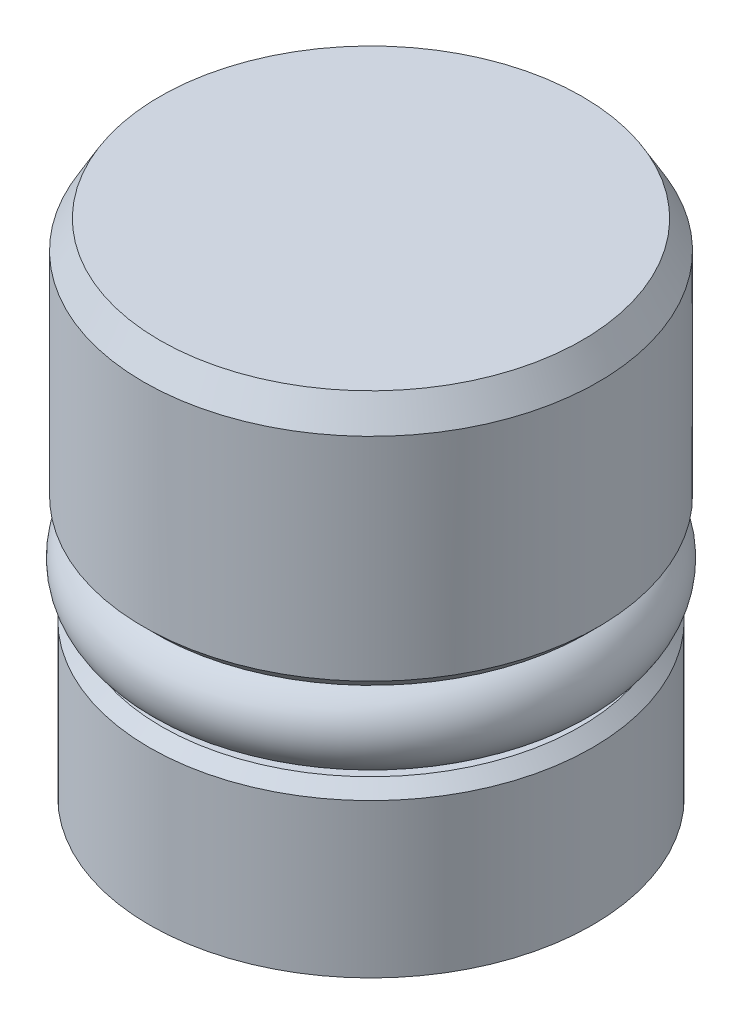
ISO-10303-21;
HEADER;
FILE_DESCRIPTION(('STEP AP214'),'2;1');
FILE_NAME('part.step','',(''),(''),'','','');
FILE_SCHEMA(('AUTOMOTIVE_DESIGN { 1 0 10303 214 1 1 1 1 }'));
ENDSEC;
DATA;
#1=APPLICATION_CONTEXT('core data for automotive mechanical design processes');
#2=APPLICATION_PROTOCOL_DEFINITION('international standard','automotive_design',2000,#1);
#3=PRODUCT_CONTEXT('',#1,'mechanical');
#4=PRODUCT('Part','Part','',(#3));
#5=PRODUCT_RELATED_PRODUCT_CATEGORY('part','',(#4));
#6=PRODUCT_DEFINITION_FORMATION('','',#4);
#7=PRODUCT_DEFINITION_CONTEXT('part definition',#1,'design');
#8=PRODUCT_DEFINITION('design','',#6,#7);
#9=PRODUCT_DEFINITION_SHAPE('','',#8);
#10=(LENGTH_UNIT() NAMED_UNIT(*) SI_UNIT(.MILLI.,.METRE.));
#11=(NAMED_UNIT(*) PLANE_ANGLE_UNIT() SI_UNIT($,.RADIAN.));
#12=(NAMED_UNIT(*) SI_UNIT($,.STERADIAN.) SOLID_ANGLE_UNIT());
#13=UNCERTAINTY_MEASURE_WITH_UNIT(LENGTH_MEASURE(1.E-05),#10,'distance_accuracy_value','');
#14=(GEOMETRIC_REPRESENTATION_CONTEXT(3) GLOBAL_UNCERTAINTY_ASSIGNED_CONTEXT((#13)) GLOBAL_UNIT_ASSIGNED_CONTEXT((#10,
#11,#12)) REPRESENTATION_CONTEXT('',''));
#15=CARTESIAN_POINT('',(0.,0.,0.));
#16=DIRECTION('',(0.,0.,1.));
#17=DIRECTION('',(1.,0.,0.));
#18=AXIS2_PLACEMENT_3D('',#15,#16,#17);
#19=CARTESIAN_POINT('',(0.,0.,0.));
#20=DIRECTION('',(0.,-1.,0.));
#21=DIRECTION('',(0.,0.,-1.));
#22=AXIS2_PLACEMENT_3D('',#19,#20,#21);
#23=PLANE('',#22);
#24=CARTESIAN_POINT('',(0.,0.,0.));
#25=DIRECTION('',(0.,-1.,0.));
#26=DIRECTION('',(0.,0.,-1.));
#27=AXIS2_PLACEMENT_3D('',#24,#25,#26);
#28=CIRCLE('',#27,5.5518939);
#29=CARTESIAN_POINT('',(0.,0.,-5.5518939));
#30=VERTEX_POINT('',#29);
#31=EDGE_CURVE('P0_E36',#30,#30,#28,.T.);
#32=ORIENTED_EDGE('',*,*,#31,.F.);
#33=EDGE_LOOP('',(#32));
#34=FACE_BOUND('',#33,.T.);
#35=CARTESIAN_POINT('',(0.,0.,0.));
#36=DIRECTION('',(0.,-1.,0.));
#37=DIRECTION('',(0.,0.,-1.));
#38=AXIS2_PLACEMENT_3D('',#35,#36,#37);
#39=CIRCLE('',#38,6.9596);
#40=CARTESIAN_POINT('',(0.,0.,-6.9596));
#41=VERTEX_POINT('',#40);
#42=EDGE_CURVE('P0_E56',#41,#41,#39,.T.);
#43=ORIENTED_EDGE('',*,*,#42,.T.);
#44=EDGE_LOOP('',(#43));
#45=FACE_BOUND('',#44,.T.);
#46=ADVANCED_FACE('P0_F16',(#34,#45),#23,.T.);
#47=CARTESIAN_POINT('',(0.,0.,0.));
#48=DIRECTION('',(0.,-1.,0.));
#49=DIRECTION('',(0.,0.,-1.));
#50=AXIS2_PLACEMENT_3D('',#47,#48,#49);
#51=CYLINDRICAL_SURFACE('',#50,6.9596);
#52=CARTESIAN_POINT('',(0.,4.826,0.));
#53=DIRECTION('',(0.,1.,0.));
#54=DIRECTION('',(0.,0.,1.));
#55=AXIS2_PLACEMENT_3D('',#52,#53,#54);
#56=CIRCLE('',#55,6.9596);
#57=CARTESIAN_POINT('',(0.,4.826,6.9596));
#58=VERTEX_POINT('',#57);
#59=EDGE_CURVE('P0_E59',#58,#58,#56,.F.);
#60=ORIENTED_EDGE('',*,*,#59,.T.);
#61=EDGE_LOOP('',(#60));
#62=FACE_BOUND('',#61,.T.);
#63=ORIENTED_EDGE('',*,*,#42,.F.);
#64=EDGE_LOOP('',(#63));
#65=FACE_BOUND('',#64,.T.);
#66=ADVANCED_FACE('P0_F88',(#62,#65),#51,.T.);
#67=CARTESIAN_POINT('',(6.9596,5.207,0.));
#68=DIRECTION('',(0.,1.,0.));
#69=DIRECTION('',(0.,0.,1.));
#70=AXIS2_PLACEMENT_3D('',#67,#68,#69);
#71=PLANE('',#70);
#72=CARTESIAN_POINT('',(0.,5.207,0.));
#73=DIRECTION('',(0.,1.,0.));
#74=DIRECTION('',(0.,0.,1.));
#75=AXIS2_PLACEMENT_3D('',#72,#73,#74);
#76=CIRCLE('',#75,6.5786);
#77=CARTESIAN_POINT('',(0.,5.207,6.5786));
#78=VERTEX_POINT('',#77);
#79=EDGE_CURVE('P0_E62',#78,#78,#76,.T.);
#80=ORIENTED_EDGE('',*,*,#79,.T.);
#81=EDGE_LOOP('',(#80));
#82=FACE_BOUND('',#81,.T.);
#83=CARTESIAN_POINT('',(0.,5.207,0.));
#84=DIRECTION('',(0.,-1.,0.));
#85=DIRECTION('',(0.,0.,-1.));
#86=AXIS2_PLACEMENT_3D('',#83,#84,#85);
#87=CIRCLE('',#86,4.4831);
#88=CARTESIAN_POINT('',(0.,5.207,-4.4831));
#89=VERTEX_POINT('',#88);
#90=EDGE_CURVE('P0_E53',#89,#89,#87,.T.);
#91=ORIENTED_EDGE('',*,*,#90,.T.);
#92=EDGE_LOOP('',(#91));
#93=FACE_BOUND('',#92,.T.);
#94=ADVANCED_FACE('P0_F95',(#82,#93),#71,.T.);
#95=CARTESIAN_POINT('',(0.,0.,0.));
#96=DIRECTION('',(0.,-1.,0.));
#97=DIRECTION('',(0.,0.,-1.));
#98=AXIS2_PLACEMENT_3D('',#95,#96,#97);
#99=CYLINDRICAL_SURFACE('',#98,4.4831);
#100=CARTESIAN_POINT('',(0.,7.8232,0.));
#101=DIRECTION('',(0.,-1.,0.));
#102=DIRECTION('',(0.,0.,-1.));
#103=AXIS2_PLACEMENT_3D('',#100,#101,#102);
#104=CIRCLE('',#103,4.4831);
#105=CARTESIAN_POINT('',(0.,7.8232,-4.4831));
#106=VERTEX_POINT('',#105);
#107=EDGE_CURVE('P0_E50',#106,#106,#104,.T.);
#108=ORIENTED_EDGE('',*,*,#107,.T.);
#109=EDGE_LOOP('',(#108));
#110=FACE_BOUND('',#109,.T.);
#111=ORIENTED_EDGE('',*,*,#90,.F.);
#112=EDGE_LOOP('',(#111));
#113=FACE_BOUND('',#112,.T.);
#114=ADVANCED_FACE('P0_F117',(#110,#113),#99,.T.);
#115=CARTESIAN_POINT('',(4.4831,7.8232,0.));
#116=DIRECTION('',(0.,-1.,0.));
#117=DIRECTION('',(0.,0.,-1.));
#118=AXIS2_PLACEMENT_3D('',#115,#116,#117);
#119=PLANE('',#118);
#120=CARTESIAN_POINT('',(0.,7.8232,0.));
#121=DIRECTION('',(0.,-1.,0.));
#122=DIRECTION('',(0.,0.,-1.));
#123=AXIS2_PLACEMENT_3D('',#120,#121,#122);
#124=CIRCLE('',#123,6.76275);
#125=CARTESIAN_POINT('',(0.,7.8232,-6.76275));
#126=VERTEX_POINT('',#125);
#127=EDGE_CURVE('P0_E65',#126,#126,#124,.T.);
#128=ORIENTED_EDGE('',*,*,#127,.T.);
#129=EDGE_LOOP('',(#128));
#130=FACE_BOUND('',#129,.T.);
#131=ORIENTED_EDGE('',*,*,#107,.F.);
#132=EDGE_LOOP('',(#131));
#133=FACE_BOUND('',#132,.T.);
#134=ADVANCED_FACE('P0_F121',(#130,#133),#119,.T.);
#135=CARTESIAN_POINT('',(0.,0.,0.));
#136=DIRECTION('',(0.,-1.,0.));
#137=DIRECTION('',(0.,0.,-1.));
#138=AXIS2_PLACEMENT_3D('',#135,#136,#137);
#139=CYLINDRICAL_SURFACE('',#138,7.14375);
#140=CARTESIAN_POINT('',(0.,14.868118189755,0.));
#141=DIRECTION('',(0.,1.,0.));
#142=DIRECTION('',(0.,0.,1.));
#143=AXIS2_PLACEMENT_3D('',#140,#141,#142);
#144=CIRCLE('',#143,7.14375);
#145=CARTESIAN_POINT('',(0.,14.868118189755,7.14375));
#146=VERTEX_POINT('',#145);
#147=EDGE_CURVE('P0_E23',#146,#146,#144,.F.);
#148=ORIENTED_EDGE('',*,*,#147,.T.);
#149=EDGE_LOOP('',(#148));
#150=FACE_BOUND('',#149,.T.);
#151=CARTESIAN_POINT('',(0.,8.2042,0.));
#152=DIRECTION('',(0.,-1.,0.));
#153=DIRECTION('',(0.,0.,-1.));
#154=AXIS2_PLACEMENT_3D('',#151,#152,#153);
#155=CIRCLE('',#154,7.14375);
#156=CARTESIAN_POINT('',(0.,8.2042,-7.14375));
#157=VERTEX_POINT('',#156);
#158=EDGE_CURVE('P0_E68',#157,#157,#155,.F.);
#159=ORIENTED_EDGE('',*,*,#158,.T.);
#160=EDGE_LOOP('',(#159));
#161=FACE_BOUND('',#160,.T.);
#162=ADVANCED_FACE('P0_F73',(#150,#161),#139,.T.);
#163=CARTESIAN_POINT('',(7.14375,15.748,0.));
#164=DIRECTION('',(0.,1.,0.));
#165=DIRECTION('',(0.,0.,1.));
#166=AXIS2_PLACEMENT_3D('',#163,#164,#165);
#167=PLANE('',#166);
#168=CARTESIAN_POINT('',(0.,15.748,0.));
#169=DIRECTION('',(0.,1.,0.));
#170=DIRECTION('',(0.,0.,1.));
#171=AXIS2_PLACEMENT_3D('',#168,#169,#170);
#172=CIRCLE('',#171,6.63575);
#173=CARTESIAN_POINT('',(0.,15.748,6.63575));
#174=VERTEX_POINT('',#173);
#175=EDGE_CURVE('P0_E11',#174,#174,#172,.T.);
#176=ORIENTED_EDGE('',*,*,#175,.T.);
#177=EDGE_LOOP('',(#176));
#178=FACE_BOUND('',#177,.T.);
#179=ADVANCED_FACE('P0_F133',(#178),#167,.T.);
#180=CARTESIAN_POINT('',(0.,3.81,0.));
#181=DIRECTION('',(0.,1.,0.));
#182=DIRECTION('',(0.,0.,1.));
#183=AXIS2_PLACEMENT_3D('',#180,#181,#182);
#184=PLANE('',#183);
#185=CARTESIAN_POINT('',(0.,3.81,0.));
#186=DIRECTION('',(0.,-1.,0.));
#187=DIRECTION('',(0.,0.,-1.));
#188=AXIS2_PLACEMENT_3D('',#185,#186,#187);
#189=CIRCLE('',#188,2.0193);
#190=CARTESIAN_POINT('',(0.,3.81,-2.0193));
#191=VERTEX_POINT('',#190);
#192=EDGE_CURVE('P0_E37',#191,#191,#189,.T.);
#193=ORIENTED_EDGE('',*,*,#192,.F.);
#194=EDGE_LOOP('',(#193));
#195=FACE_BOUND('',#194,.T.);
#196=CARTESIAN_POINT('',(0.,3.81,0.));
#197=DIRECTION('',(0.,-1.,0.));
#198=DIRECTION('',(0.,0.,-1.));
#199=AXIS2_PLACEMENT_3D('',#196,#197,#198);
#200=CIRCLE('',#199,2.5527);
#201=CARTESIAN_POINT('',(0.,3.81,-2.5527));
#202=VERTEX_POINT('',#201);
#203=EDGE_CURVE('P0_E47',#202,#202,#200,.T.);
#204=ORIENTED_EDGE('',*,*,#203,.T.);
#205=EDGE_LOOP('',(#204));
#206=FACE_BOUND('',#205,.T.);
#207=ADVANCED_FACE('P0_F136',(#195,#206),#184,.F.);
#208=CARTESIAN_POINT('',(0.,0.,0.));
#209=DIRECTION('',(0.,-1.,0.));
#210=DIRECTION('',(0.,0.,-1.));
#211=AXIS2_PLACEMENT_3D('',#208,#209,#210);
#212=CYLINDRICAL_SURFACE('',#211,2.5527);
#213=ORIENTED_EDGE('',*,*,#203,.F.);
#214=EDGE_LOOP('',(#213));
#215=FACE_BOUND('',#214,.T.);
#216=CARTESIAN_POINT('',(0.,3.45017790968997,0.));
#217=DIRECTION('',(0.,-1.,0.));
#218=DIRECTION('',(0.,0.,-1.));
#219=AXIS2_PLACEMENT_3D('',#216,#217,#218);
#220=CIRCLE('',#219,2.5527);
#221=CARTESIAN_POINT('',(0.,3.45017790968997,-2.5527));
#222=VERTEX_POINT('',#221);
#223=EDGE_CURVE('P0_E40',#222,#222,#220,.T.);
#224=ORIENTED_EDGE('',*,*,#223,.T.);
#225=EDGE_LOOP('',(#224));
#226=FACE_BOUND('',#225,.T.);
#227=ADVANCED_FACE('P0_F140',(#215,#226),#212,.F.);
#228=CARTESIAN_POINT('',(0.,0.,0.));
#229=DIRECTION('',(0.,-1.,0.));
#230=DIRECTION('',(0.,0.,-1.));
#231=AXIS2_PLACEMENT_3D('',#228,#229,#230);
#232=CONICAL_SURFACE('',#231,5.5518939,0.715584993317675);
#233=ORIENTED_EDGE('',*,*,#223,.F.);
#234=EDGE_LOOP('',(#233));
#235=FACE_BOUND('',#234,.T.);
#236=ORIENTED_EDGE('',*,*,#31,.T.);
#237=EDGE_LOOP('',(#236));
#238=FACE_BOUND('',#237,.T.);
#239=ADVANCED_FACE('P0_F30',(#235,#238),#232,.F.);
#240=CARTESIAN_POINT('',(0.,11.684,0.));
#241=DIRECTION('',(0.,-1.,0.));
#242=DIRECTION('',(0.,0.,-1.));
#243=AXIS2_PLACEMENT_3D('',#240,#241,#242);
#244=CONICAL_SURFACE('',#243,2.0193,1.02974425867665);
#245=CARTESIAN_POINT('',(0.,12.8973178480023,0.));
#246=VERTEX_POINT('',#245);
#247=VERTEX_LOOP('',#246);
#248=FACE_BOUND('',#247,.T.);
#249=CARTESIAN_POINT('',(0.,11.684,0.));
#250=DIRECTION('',(0.,-1.,0.));
#251=DIRECTION('',(0.,0.,-1.));
#252=AXIS2_PLACEMENT_3D('',#249,#250,#251);
#253=CIRCLE('',#252,2.0193);
#254=CARTESIAN_POINT('',(0.,11.684,-2.0193));
#255=VERTEX_POINT('',#254);
#256=EDGE_CURVE('P0_E34',#255,#255,#253,.T.);
#257=ORIENTED_EDGE('',*,*,#256,.T.);
#258=EDGE_LOOP('',(#257));
#259=FACE_BOUND('',#258,.T.);
#260=ADVANCED_FACE('P0_F26',(#248,#259),#244,.F.);
#261=CARTESIAN_POINT('',(0.,3.81,0.));
#262=DIRECTION('',(0.,-1.,0.));
#263=DIRECTION('',(0.,0.,-1.));
#264=AXIS2_PLACEMENT_3D('',#261,#262,#263);
#265=CYLINDRICAL_SURFACE('',#264,2.0193);
#266=ORIENTED_EDGE('',*,*,#256,.F.);
#267=EDGE_LOOP('',(#266));
#268=FACE_BOUND('',#267,.T.);
#269=ORIENTED_EDGE('',*,*,#192,.T.);
#270=EDGE_LOOP('',(#269));
#271=FACE_BOUND('',#270,.T.);
#272=ADVANCED_FACE('P0_F29',(#268,#271),#265,.F.);
#273=CARTESIAN_POINT('',(0.,4.826,0.));
#274=DIRECTION('',(0.,-1.,0.));
#275=DIRECTION('',(0.,0.,-1.));
#276=AXIS2_PLACEMENT_3D('',#273,#274,#275);
#277=CONICAL_SURFACE('',#276,6.9596,0.785398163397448);
#278=ORIENTED_EDGE('',*,*,#79,.F.);
#279=EDGE_LOOP('',(#278));
#280=FACE_BOUND('',#279,.T.);
#281=ORIENTED_EDGE('',*,*,#59,.F.);
#282=EDGE_LOOP('',(#281));
#283=FACE_BOUND('',#282,.T.);
#284=ADVANCED_FACE('P0_F84',(#280,#283),#277,.T.);
#285=CARTESIAN_POINT('',(0.,7.8232,0.));
#286=DIRECTION('',(0.,1.,0.));
#287=DIRECTION('',(0.,0.,1.));
#288=AXIS2_PLACEMENT_3D('',#285,#286,#287);
#289=CONICAL_SURFACE('',#288,6.76275,0.78539816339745);
#290=ORIENTED_EDGE('',*,*,#158,.F.);
#291=EDGE_LOOP('',(#290));
#292=FACE_BOUND('',#291,.T.);
#293=ORIENTED_EDGE('',*,*,#127,.F.);
#294=EDGE_LOOP('',(#293));
#295=FACE_BOUND('',#294,.T.);
#296=ADVANCED_FACE('P0_F77',(#292,#295),#289,.T.);
#297=CARTESIAN_POINT('',(0.,14.868118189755,0.));
#298=DIRECTION('',(0.,-1.,0.));
#299=DIRECTION('',(0.,0.,-1.));
#300=AXIS2_PLACEMENT_3D('',#297,#298,#299);
#301=CONICAL_SURFACE('',#300,7.14375,0.523598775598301);
#302=ORIENTED_EDGE('',*,*,#175,.F.);
#303=EDGE_LOOP('',(#302));
#304=FACE_BOUND('',#303,.T.);
#305=ORIENTED_EDGE('',*,*,#147,.F.);
#306=EDGE_LOOP('',(#305));
#307=FACE_BOUND('',#306,.T.);
#308=ADVANCED_FACE('P0_F18',(#304,#307),#301,.T.);
#309=CLOSED_SHELL('',(#46,#66,#94,#114,#134,#162,#179,#207,#227,#239,#260,#272,#284,#296,#308));
#310=MANIFOLD_SOLID_BREP('P0_B1',#309);
#311=CARTESIAN_POINT('',(0.,6.5151,0.));
#312=DIRECTION('',(0.,-1.,0.));
#313=DIRECTION('',(0.,0.,-1.));
#314=AXIS2_PLACEMENT_3D('',#311,#312,#313);
#315=TOROIDAL_SURFACE('',#314,5.9055,1.3081);
#316=CARTESIAN_POINT('',(0.,6.5151,-7.2136));
#317=VERTEX_POINT('',#316);
#318=VERTEX_LOOP('',#317);
#319=FACE_BOUND('',#318,.T.);
#320=ADVANCED_FACE('P1_F12',(#319),#315,.T.);
#321=CLOSED_SHELL('',(#320));
#322=MANIFOLD_SOLID_BREP('P1_B1',#321);
#323=CARTESIAN_POINT('',(0.,0.382145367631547,5.2197));
#324=DIRECTION('',(0.,-1.,0.));
#325=DIRECTION('',(-1.,0.,0.));
#326=AXIS2_PLACEMENT_3D('',#323,#324,#325);
#327=PLANE('',#326);
#328=DIRECTION('',(0.866025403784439,0.,0.5));
#329=VECTOR('',#328,1.);
#330=CARTESIAN_POINT('',(0.,0.382145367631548,-1.83308710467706));
#331=LINE('',#330,#329);
#332=CARTESIAN_POINT('',(0.,0.382145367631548,-1.83308710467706));
#333=VERTEX_POINT('',#332);
#334=CARTESIAN_POINT('',(1.5875,0.382145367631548,-0.916543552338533));
#335=VERTEX_POINT('',#334);
#336=EDGE_CURVE('P2_E29',#333,#335,#331,.T.);
#337=ORIENTED_EDGE('',*,*,#336,.F.);
#338=DIRECTION('',(0.866025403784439,0.,-0.5));
#339=VECTOR('',#338,1.);
#340=CARTESIAN_POINT('',(-1.5875,0.382145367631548,-0.916543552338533));
#341=LINE('',#340,#339);
#342=CARTESIAN_POINT('',(-1.5875,0.382145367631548,-0.916543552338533));
#343=VERTEX_POINT('',#342);
#344=EDGE_CURVE('P2_E112',#343,#333,#341,.T.);
#345=ORIENTED_EDGE('',*,*,#344,.F.);
#346=DIRECTION('',(0.,0.,-1.));
#347=VECTOR('',#346,1.);
#348=CARTESIAN_POINT('',(-1.5875,0.382145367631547,0.91654355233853));
#349=LINE('',#348,#347);
#350=CARTESIAN_POINT('',(-1.5875,0.382145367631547,0.91654355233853));
#351=VERTEX_POINT('',#350);
#352=EDGE_CURVE('P2_E110',#351,#343,#349,.T.);
#353=ORIENTED_EDGE('',*,*,#352,.F.);
#354=DIRECTION('',(-0.866025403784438,0.,-0.5));
#355=VECTOR('',#354,1.);
#356=CARTESIAN_POINT('',(0.,0.382145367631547,1.83308710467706));
#357=LINE('',#356,#355);
#358=CARTESIAN_POINT('',(0.,0.382145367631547,1.83308710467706));
#359=VERTEX_POINT('',#358);
#360=EDGE_CURVE('P2_E77',#359,#351,#357,.T.);
#361=ORIENTED_EDGE('',*,*,#360,.F.);
#362=DIRECTION('',(-0.866025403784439,0.,0.5));
#363=VECTOR('',#362,1.);
#364=CARTESIAN_POINT('',(1.5875,0.382145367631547,0.91654355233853));
#365=LINE('',#364,#363);
#366=CARTESIAN_POINT('',(1.5875,0.382145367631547,0.91654355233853));
#367=VERTEX_POINT('',#366);
#368=EDGE_CURVE('P2_E106',#367,#359,#365,.T.);
#369=ORIENTED_EDGE('',*,*,#368,.F.);
#370=DIRECTION('',(0.,0.,1.));
#371=VECTOR('',#370,1.);
#372=CARTESIAN_POINT('',(1.5875,0.382145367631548,-0.916543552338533));
#373=LINE('',#372,#371);
#374=EDGE_CURVE('P2_E103',#335,#367,#373,.T.);
#375=ORIENTED_EDGE('',*,*,#374,.F.);
#376=EDGE_LOOP('',(#337,#345,#353,#361,#369,#375));
#377=FACE_BOUND('',#376,.T.);
#378=CARTESIAN_POINT('',(0.,0.382145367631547,0.));
#379=DIRECTION('',(0.,1.,0.));
#380=DIRECTION('',(1.,0.,0.));
#381=AXIS2_PLACEMENT_3D('',#378,#379,#380);
#382=CIRCLE('',#381,5.2197);
#383=CARTESIAN_POINT('',(5.2197,0.382145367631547,0.));
#384=VERTEX_POINT('',#383);
#385=EDGE_CURVE('P2_E10',#384,#384,#382,.T.);
#386=ORIENTED_EDGE('',*,*,#385,.F.);
#387=EDGE_LOOP('',(#386));
#388=FACE_BOUND('',#387,.T.);
#389=ADVANCED_FACE('P2_F15',(#377,#388),#327,.T.);
#390=CARTESIAN_POINT('',(0.,3.61088437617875,0.));
#391=DIRECTION('',(0.,-1.,0.));
#392=DIRECTION('',(-1.,0.,0.));
#393=AXIS2_PLACEMENT_3D('',#390,#391,#392);
#394=CONICAL_SURFACE('',#393,2.413,0.715584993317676);
#395=ORIENTED_EDGE('',*,*,#385,.T.);
#396=EDGE_LOOP('',(#395));
#397=FACE_BOUND('',#396,.T.);
#398=CARTESIAN_POINT('',(0.,3.61088437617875,0.));
#399=DIRECTION('',(0.,1.,0.));
#400=DIRECTION('',(1.,0.,0.));
#401=AXIS2_PLACEMENT_3D('',#398,#399,#400);
#402=CIRCLE('',#401,2.413);
#403=CARTESIAN_POINT('',(2.413,3.61088437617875,0.));
#404=VERTEX_POINT('',#403);
#405=EDGE_CURVE('P2_E22',#404,#404,#402,.T.);
#406=ORIENTED_EDGE('',*,*,#405,.F.);
#407=EDGE_LOOP('',(#406));
#408=FACE_BOUND('',#407,.T.);
#409=ADVANCED_FACE('P2_F129',(#397,#408),#394,.T.);
#410=CARTESIAN_POINT('',(0.,9.90714536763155,0.));
#411=DIRECTION('',(0.,1.,0.));
#412=DIRECTION('',(1.,0.,0.));
#413=AXIS2_PLACEMENT_3D('',#410,#411,#412);
#414=CYLINDRICAL_SURFACE('',#413,2.413);
#415=ORIENTED_EDGE('',*,*,#405,.T.);
#416=EDGE_LOOP('',(#415));
#417=FACE_BOUND('',#416,.T.);
#418=CARTESIAN_POINT('',(0.,9.90714536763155,0.));
#419=DIRECTION('',(0.,1.,0.));
#420=DIRECTION('',(1.,0.,0.));
#421=AXIS2_PLACEMENT_3D('',#418,#419,#420);
#422=CIRCLE('',#421,2.413);
#423=CARTESIAN_POINT('',(2.413,9.90714536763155,0.));
#424=VERTEX_POINT('',#423);
#425=EDGE_CURVE('P2_E116',#424,#424,#422,.T.);
#426=ORIENTED_EDGE('',*,*,#425,.F.);
#427=EDGE_LOOP('',(#426));
#428=FACE_BOUND('',#427,.T.);
#429=ADVANCED_FACE('P2_F126',(#417,#428),#414,.T.);
#430=CARTESIAN_POINT('',(0.,9.90714536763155,0.));
#431=DIRECTION('',(0.,1.,0.));
#432=DIRECTION('',(1.,0.,0.));
#433=AXIS2_PLACEMENT_3D('',#430,#431,#432);
#434=PLANE('',#433);
#435=ORIENTED_EDGE('',*,*,#425,.T.);
#436=EDGE_LOOP('',(#435));
#437=FACE_BOUND('',#436,.T.);
#438=ADVANCED_FACE('P2_F138',(#437),#434,.T.);
#439=CARTESIAN_POINT('',(0.,3.43014536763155,-1.83308710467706));
#440=DIRECTION('',(0.5,0.,-0.866025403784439));
#441=DIRECTION('',(-0.866025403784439,0.,-0.5));
#442=AXIS2_PLACEMENT_3D('',#439,#440,#441);
#443=PLANE('',#442);
#444=ORIENTED_EDGE('',*,*,#336,.T.);
#445=DIRECTION('',(0.,-1.,0.));
#446=VECTOR('',#445,1.);
#447=CARTESIAN_POINT('',(1.5875,3.43014536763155,-0.916543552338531));
#448=LINE('',#447,#446);
#449=CARTESIAN_POINT('',(1.5875,3.43014536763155,-0.916543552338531));
#450=VERTEX_POINT('',#449);
#451=EDGE_CURVE('P2_E59',#450,#335,#448,.T.);
#452=ORIENTED_EDGE('',*,*,#451,.F.);
#453=DIRECTION('',(0.866025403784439,0.,0.5));
#454=VECTOR('',#453,1.);
#455=CARTESIAN_POINT('',(0.,3.43014536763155,-1.83308710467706));
#456=LINE('',#455,#454);
#457=CARTESIAN_POINT('',(0.,3.43014536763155,-1.83308710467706));
#458=VERTEX_POINT('',#457);
#459=EDGE_CURVE('P2_E114',#458,#450,#456,.T.);
#460=ORIENTED_EDGE('',*,*,#459,.F.);
#461=DIRECTION('',(0.,-1.,0.));
#462=VECTOR('',#461,1.);
#463=CARTESIAN_POINT('',(0.,3.43014536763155,-1.83308710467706));
#464=LINE('',#463,#462);
#465=EDGE_CURVE('P2_E37',#458,#333,#464,.T.);
#466=ORIENTED_EDGE('',*,*,#465,.T.);
#467=EDGE_LOOP('',(#444,#452,#460,#466));
#468=FACE_BOUND('',#467,.T.);
#469=ADVANCED_FACE('P2_F144',(#468),#443,.F.);
#470=CARTESIAN_POINT('',(-1.5875,3.43014536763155,-0.916543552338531));
#471=DIRECTION('',(-0.5,0.,-0.866025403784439));
#472=DIRECTION('',(-0.866025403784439,0.,0.5));
#473=AXIS2_PLACEMENT_3D('',#470,#471,#472);
#474=PLANE('',#473);
#475=ORIENTED_EDGE('',*,*,#344,.T.);
#476=ORIENTED_EDGE('',*,*,#465,.F.);
#477=DIRECTION('',(0.866025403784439,0.,-0.5));
#478=VECTOR('',#477,1.);
#479=CARTESIAN_POINT('',(-1.5875,3.43014536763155,-0.916543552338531));
#480=LINE('',#479,#478);
#481=CARTESIAN_POINT('',(-1.5875,3.43014536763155,-0.916543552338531));
#482=VERTEX_POINT('',#481);
#483=EDGE_CURVE('P2_E89',#482,#458,#480,.T.);
#484=ORIENTED_EDGE('',*,*,#483,.F.);
#485=DIRECTION('',(0.,-1.,0.));
#486=VECTOR('',#485,1.);
#487=CARTESIAN_POINT('',(-1.5875,3.43014536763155,-0.916543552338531));
#488=LINE('',#487,#486);
#489=EDGE_CURVE('P2_E81',#482,#343,#488,.T.);
#490=ORIENTED_EDGE('',*,*,#489,.T.);
#491=EDGE_LOOP('',(#475,#476,#484,#490));
#492=FACE_BOUND('',#491,.T.);
#493=ADVANCED_FACE('P2_F148',(#492),#474,.F.);
#494=CARTESIAN_POINT('',(-1.5875,3.43014536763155,0.916543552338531));
#495=DIRECTION('',(-1.,0.,0.));
#496=DIRECTION('',(0.,0.,1.));
#497=AXIS2_PLACEMENT_3D('',#494,#495,#496);
#498=PLANE('',#497);
#499=ORIENTED_EDGE('',*,*,#352,.T.);
#500=ORIENTED_EDGE('',*,*,#489,.F.);
#501=DIRECTION('',(0.,0.,-1.));
#502=VECTOR('',#501,1.);
#503=CARTESIAN_POINT('',(-1.5875,3.43014536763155,0.916543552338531));
#504=LINE('',#503,#502);
#505=CARTESIAN_POINT('',(-1.5875,3.43014536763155,0.916543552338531));
#506=VERTEX_POINT('',#505);
#507=EDGE_CURVE('P2_E85',#506,#482,#504,.T.);
#508=ORIENTED_EDGE('',*,*,#507,.F.);
#509=DIRECTION('',(0.,-1.,0.));
#510=VECTOR('',#509,1.);
#511=CARTESIAN_POINT('',(-1.5875,3.43014536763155,0.916543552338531));
#512=LINE('',#511,#510);
#513=EDGE_CURVE('P2_E70',#506,#351,#512,.T.);
#514=ORIENTED_EDGE('',*,*,#513,.T.);
#515=EDGE_LOOP('',(#499,#500,#508,#514));
#516=FACE_BOUND('',#515,.T.);
#517=ADVANCED_FACE('P2_F86',(#516),#498,.F.);
#518=CARTESIAN_POINT('',(0.,3.43014536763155,1.83308710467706));
#519=DIRECTION('',(-0.5,0.,0.866025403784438));
#520=DIRECTION('',(0.866025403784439,0.,0.5));
#521=AXIS2_PLACEMENT_3D('',#518,#519,#520);
#522=PLANE('',#521);
#523=ORIENTED_EDGE('',*,*,#360,.T.);
#524=ORIENTED_EDGE('',*,*,#513,.F.);
#525=DIRECTION('',(-0.866025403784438,0.,-0.5));
#526=VECTOR('',#525,1.);
#527=CARTESIAN_POINT('',(0.,3.43014536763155,1.83308710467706));
#528=LINE('',#527,#526);
#529=CARTESIAN_POINT('',(0.,3.43014536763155,1.83308710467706));
#530=VERTEX_POINT('',#529);
#531=EDGE_CURVE('P2_E74',#530,#506,#528,.T.);
#532=ORIENTED_EDGE('',*,*,#531,.F.);
#533=DIRECTION('',(0.,-1.,0.));
#534=VECTOR('',#533,1.);
#535=CARTESIAN_POINT('',(0.,3.43014536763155,1.83308710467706));
#536=LINE('',#535,#534);
#537=EDGE_CURVE('P2_E82',#530,#359,#536,.T.);
#538=ORIENTED_EDGE('',*,*,#537,.T.);
#539=EDGE_LOOP('',(#523,#524,#532,#538));
#540=FACE_BOUND('',#539,.T.);
#541=ADVANCED_FACE('P2_F72',(#540),#522,.F.);
#542=CARTESIAN_POINT('',(1.5875,3.43014536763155,0.916543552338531));
#543=DIRECTION('',(0.5,0.,0.866025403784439));
#544=DIRECTION('',(0.866025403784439,0.,-0.5));
#545=AXIS2_PLACEMENT_3D('',#542,#543,#544);
#546=PLANE('',#545);
#547=ORIENTED_EDGE('',*,*,#368,.T.);
#548=ORIENTED_EDGE('',*,*,#537,.F.);
#549=DIRECTION('',(-0.866025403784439,0.,0.5));
#550=VECTOR('',#549,1.);
#551=CARTESIAN_POINT('',(1.5875,3.43014536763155,0.916543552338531));
#552=LINE('',#551,#550);
#553=CARTESIAN_POINT('',(1.5875,3.43014536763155,0.916543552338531));
#554=VERTEX_POINT('',#553);
#555=EDGE_CURVE('P2_E95',#554,#530,#552,.T.);
#556=ORIENTED_EDGE('',*,*,#555,.F.);
#557=DIRECTION('',(0.,-1.,0.));
#558=VECTOR('',#557,1.);
#559=CARTESIAN_POINT('',(1.5875,3.43014536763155,0.916543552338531));
#560=LINE('',#559,#558);
#561=EDGE_CURVE('P2_E119',#554,#367,#560,.T.);
#562=ORIENTED_EDGE('',*,*,#561,.T.);
#563=EDGE_LOOP('',(#547,#548,#556,#562));
#564=FACE_BOUND('',#563,.T.);
#565=ADVANCED_FACE('P2_F152',(#564),#546,.F.);
#566=CARTESIAN_POINT('',(1.5875,3.43014536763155,-0.916543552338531));
#567=DIRECTION('',(1.,0.,0.));
#568=DIRECTION('',(0.,-1.,0.));
#569=AXIS2_PLACEMENT_3D('',#566,#567,#568);
#570=PLANE('',#569);
#571=ORIENTED_EDGE('',*,*,#374,.T.);
#572=ORIENTED_EDGE('',*,*,#561,.F.);
#573=DIRECTION('',(0.,0.,1.));
#574=VECTOR('',#573,1.);
#575=CARTESIAN_POINT('',(1.5875,3.43014536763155,-0.916543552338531));
#576=LINE('',#575,#574);
#577=EDGE_CURVE('P2_E97',#450,#554,#576,.T.);
#578=ORIENTED_EDGE('',*,*,#577,.F.);
#579=ORIENTED_EDGE('',*,*,#451,.T.);
#580=EDGE_LOOP('',(#571,#572,#578,#579));
#581=FACE_BOUND('',#580,.T.);
#582=ADVANCED_FACE('P2_F149',(#581),#570,.F.);
#583=CARTESIAN_POINT('',(3.175,3.43014536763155,0.));
#584=DIRECTION('',(0.,-1.,0.));
#585=DIRECTION('',(-1.,0.,0.));
#586=AXIS2_PLACEMENT_3D('',#583,#584,#585);
#587=PLANE('',#586);
#588=ORIENTED_EDGE('',*,*,#459,.T.);
#589=ORIENTED_EDGE('',*,*,#577,.T.);
#590=ORIENTED_EDGE('',*,*,#555,.T.);
#591=ORIENTED_EDGE('',*,*,#531,.T.);
#592=ORIENTED_EDGE('',*,*,#507,.T.);
#593=ORIENTED_EDGE('',*,*,#483,.T.);
#594=EDGE_LOOP('',(#588,#589,#590,#591,#592,#593));
#595=FACE_BOUND('',#594,.T.);
#596=ADVANCED_FACE('P2_F92',(#595),#587,.T.);
#597=CLOSED_SHELL('',(#389,#409,#429,#438,#469,#493,#517,#541,#565,#582,#596));
#598=MANIFOLD_SOLID_BREP('P2_B1',#597);
#599=ADVANCED_BREP_SHAPE_REPRESENTATION('',(#18,#310,#322,#598),#14);
#600=SHAPE_DEFINITION_REPRESENTATION(#9,#599);
ENDSEC;
END-ISO-10303-21;
